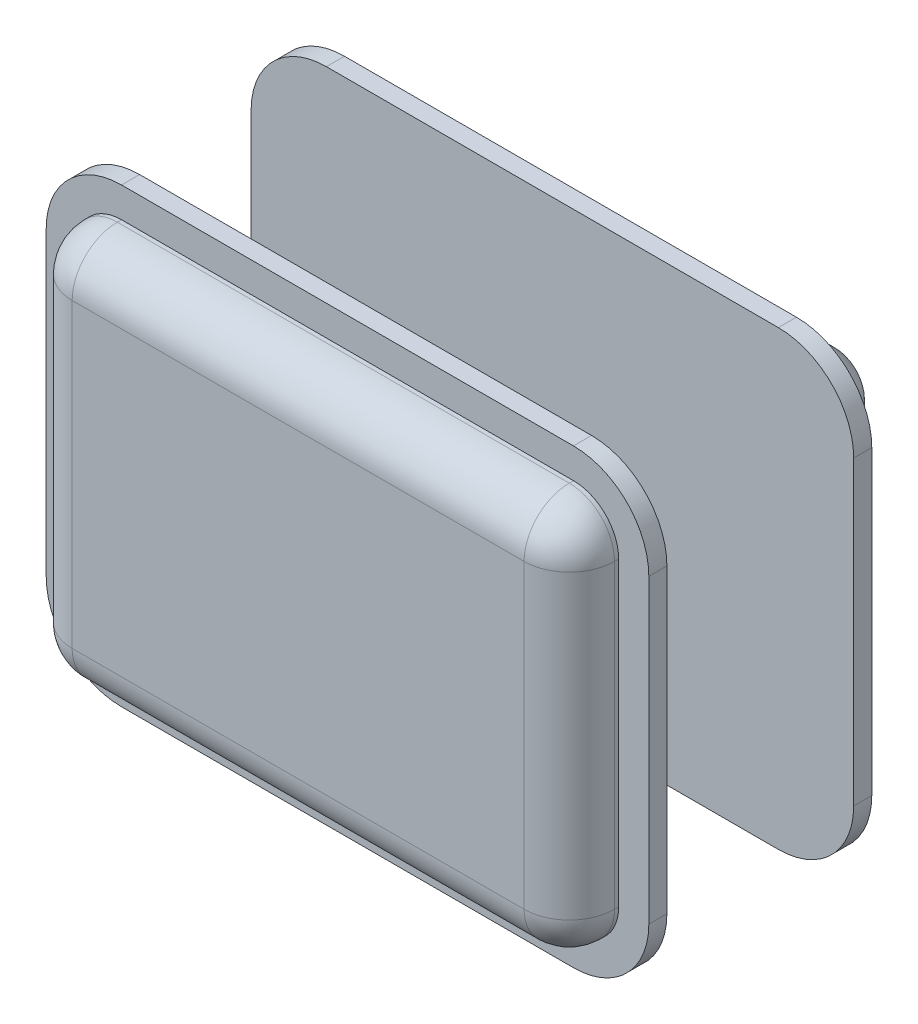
from build123d import *

# Parameters (mm, degrees)
BOSS_EXTRU_1_START      = 31
BOSS_EXTRU_1_DEPTH      = 6
BALLAST_P_V_DEPTH       = 16.4
CONG_1_R                = 15
ESQUISSE4_R             = 7
BOSS_EXTRU_3_DEPTH      = 31
BOSS_EXTRU_4_DEPTH      = 12
BOSS_EXTRU_4_DEPTH_BACK = 90
ESQUISSE5_R             = 7
ESQUISSE6_W             = 22
ESQUISSE6_H             = 22
BOSS_EXTRU_5_DEPTH      = 11
CONG_1_OF_SYM_TRIE1_R   = 15


with BuildPart() as part:
    # Esquisse1 → Boss.-Extru.1 (new body)
    with BuildSketch(Plane.XY.offset(BOSS_EXTRU_1_START)):
        with BuildLine():
            Line((-35, 75), (115, 75))
            ThreePointArc((115, 75), (132.67766953, 67.67766953), (140, 50))
            Line((140, 50), (140, -50))
            ThreePointArc((140, -50), (132.67766953, -67.67766953), (115, -75))
            Line((115, -75), (-35, -75))
            ThreePointArc((-35, -75), (-52.67766953, -67.67766953), (-60, -50))
            Line((-60, -50), (-60, 50))
            ThreePointArc((-60, 50), (-52.67766953, 67.67766953), (-35, 75))
        make_face()
    boss_extru_1 = extrude(amount=BOSS_EXTRU_1_DEPTH)

    # Esquisse2 → ballast p-v (add)
    with BuildSketch(Plane.XY.offset(37)):
        with BuildLine():
            Line((130, -50), (130, 50))
            ThreePointArc((130, 50), (125.606601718, 60.606601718), (115, 65))
            Line((115, 65), (-35, 65))
            ThreePointArc((-35, 65), (-45.606601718, 60.606601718), (-50, 50))
            Line((-50, 50), (-50, -50))
            ThreePointArc((-50, -50), (-45.606601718, -60.606601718), (-35, -65))
            Line((-35, -65), (115, -65))
            ThreePointArc((115, -65), (125.606601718, -60.606601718), (130, -50))
        make_face()
    ballast_p_v = extrude(amount=BALLAST_P_V_DEPTH)

    # Cong_1
    cong_1_edges = [part.edges().sort_by_distance(p)[0] for p in [
        (125.606601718, -60.606601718, 53.4),
        (130, 0, 53.4),
        (125.606601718, 60.606601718, 53.4),
        (40, 65, 53.4),
        (-45.606601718, 60.606601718, 53.4),
        (-50, 0, 53.4),
        (-45.606601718, -60.606601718, 53.4),
        (40, -65, 53.4),
    ]]
    fillet(cong_1_edges, radius=CONG_1_R)

    # Esquisse4 → Boss.-Extru.3 (add, symmetric)
    with BuildSketch(Plane.XY):
        Circle(ESQUISSE4_R)
    extrude(amount=BOSS_EXTRU_3_DEPTH, both=True)

    # Esquisse5 → Boss.-Extru.4 (add, two sides: drawn at the far end of the back side and taken through both)
    with BuildSketch(Plane(origin=(0, 0, 0), x_dir=(0, 0, -1), z_dir=(1, 0, 0)).offset(-BOSS_EXTRU_4_DEPTH_BACK)):
        with Locations(Location((0, 0, 0), (0, 0, 270))):
            Circle(ESQUISSE5_R)
    extrude(amount=BOSS_EXTRU_4_DEPTH + BOSS_EXTRU_4_DEPTH_BACK)

    # Esquisse6 → Boss.-Extru.5 (add, symmetric)
    with BuildSketch(Plane(origin=(0, 0, 0), x_dir=(1, 0, 0), z_dir=(0, 1, 0))):
        Rectangle(ESQUISSE6_W, ESQUISSE6_H)
    extrude(amount=BOSS_EXTRU_5_DEPTH, both=True)

    # Sym_trie1: Boss.-Extru.1, ballast p-v across plane
    add(boss_extru_1.mirror(Plane.XY))
    add(ballast_p_v.mirror(Plane.XY))

    # Cong_1 of Sym_trie1
    cong_1_of_sym_trie1_edges = [part.edges().sort_by_distance(p)[0] for p in [
        (125.606601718, -60.606601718, -53.4),
        (130, 0, -53.4),
        (125.606601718, 60.606601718, -53.4),
        (40, 65, -53.4),
        (-45.606601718, 60.606601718, -53.4),
        (-50, 0, -53.4),
        (-45.606601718, -60.606601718, -53.4),
        (40, -65, -53.4),
    ]]
    fillet(cong_1_of_sym_trie1_edges, radius=CONG_1_OF_SYM_TRIE1_R)


solid = part.part
